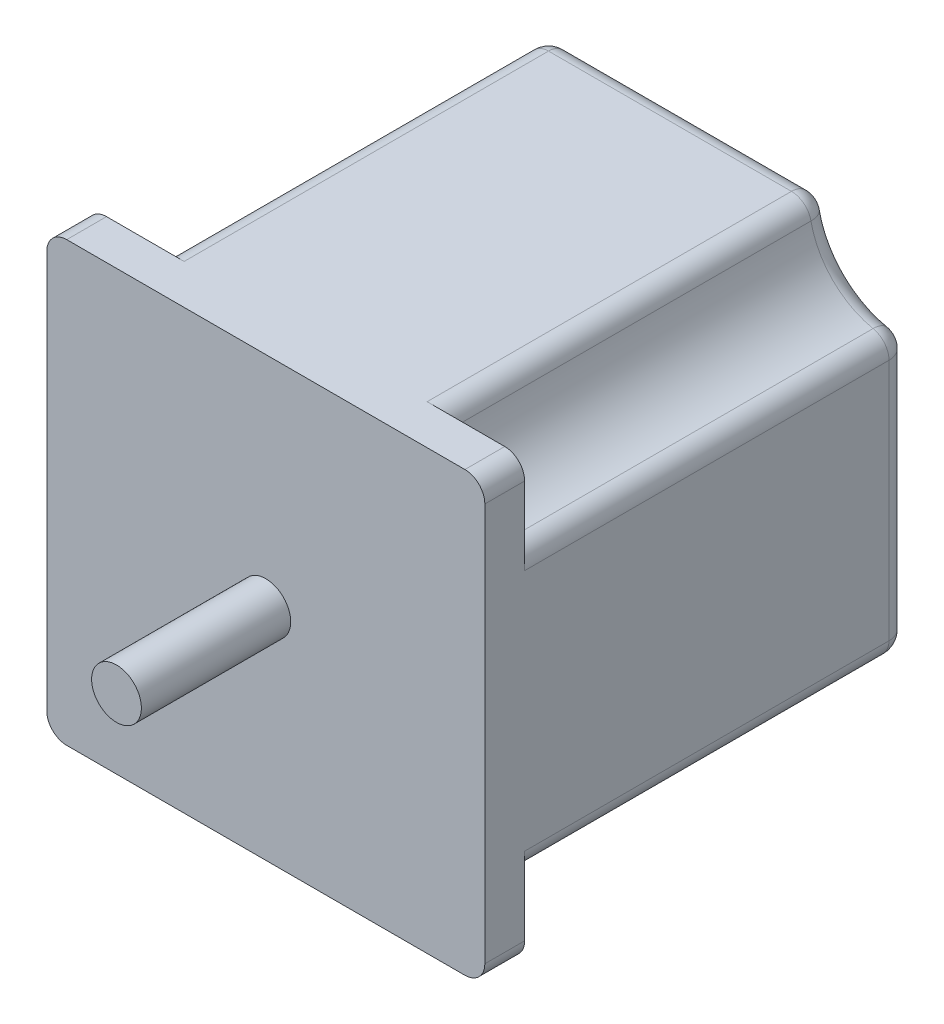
from build123d import *

# Parameters (mm, degrees)
BOSS_EXTRUDE1_DEPTH = 54.102
SKETCH3_W           = 55.88
SKETCH3_H           = 55.88
BOSS_EXTRUDE2_DEPTH = 5.08
FILLET1_R           = 2.54
SKETCH4_R           = 3.175
BOSS_EXTRUDE3_DEPTH = 19.05


with BuildPart() as part:
    # Sketch2 → Boss-Extrude1 (new body)
    with BuildSketch(Plane.XY):
        with BuildLine():
            Line((10.16, 0), (45.72, 0))
            ThreePointArc((45.72, 0), (48.695795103, 7.184204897), (55.88, 10.16))
            Line((55.88, 10.16), (55.88, 45.72))
            ThreePointArc((55.88, 45.72), (48.695795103, 48.695795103), (45.72, 55.88))
            Line((45.72, 55.88), (10.16, 55.88))
            ThreePointArc((10.16, 55.88), (7.184204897, 48.695795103), (0, 45.72))
            Line((0, 45.72), (0, 10.16))
            ThreePointArc((0, 10.16), (7.184204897, 7.184204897), (10.16, 0))
        make_face()
    extrude(amount=BOSS_EXTRUDE1_DEPTH)

    # Sketch3 → Boss-Extrude2 (add)
    with BuildSketch(Plane.XY.offset(54.102)):
        with Locations((27.94, 27.94)):
            Rectangle(SKETCH3_W, SKETCH3_H)
    extrude(amount=-BOSS_EXTRUDE2_DEPTH)

    # Fillet1
    fillet1_edges = [part.edges().sort_by_distance(p)[0] for p in [
        (27.94, 0, 0),
        (7.184204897, 7.184204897, 0),
        (0, 27.94, 0),
        (7.184204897, 48.695795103, 0),
        (10.16, 55.88, 24.511),
        (45.72, 55.88, 24.511),
        (55.88, 45.72, 24.511),
        (55.88, 10.16, 24.511),
        (45.72, 0, 24.511),
        (10.16, 0, 24.511),
        (0, 10.16, 24.511),
        (0, 45.72, 24.511),
        (55.88, 55.88, 51.562),
        (55.88, 0, 51.562),
        (0, 0, 51.562),
        (0, 55.88, 51.562),
        (27.94, 55.88, 0),
        (48.695795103, 48.695795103, 0),
        (55.88, 27.94, 0),
        (48.695795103, 7.184204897, 0),
    ]]
    fillet(fillet1_edges, radius=FILLET1_R)

    # Sketch4 → Boss-Extrude3 (add)
    with BuildSketch(Plane.XY.offset(54.102)):
        with Locations(Location((27.94, 27.94, 0), (0, 0, 180))):
            Circle(SKETCH4_R)
    extrude(amount=BOSS_EXTRUDE3_DEPTH)


solid = part.part
